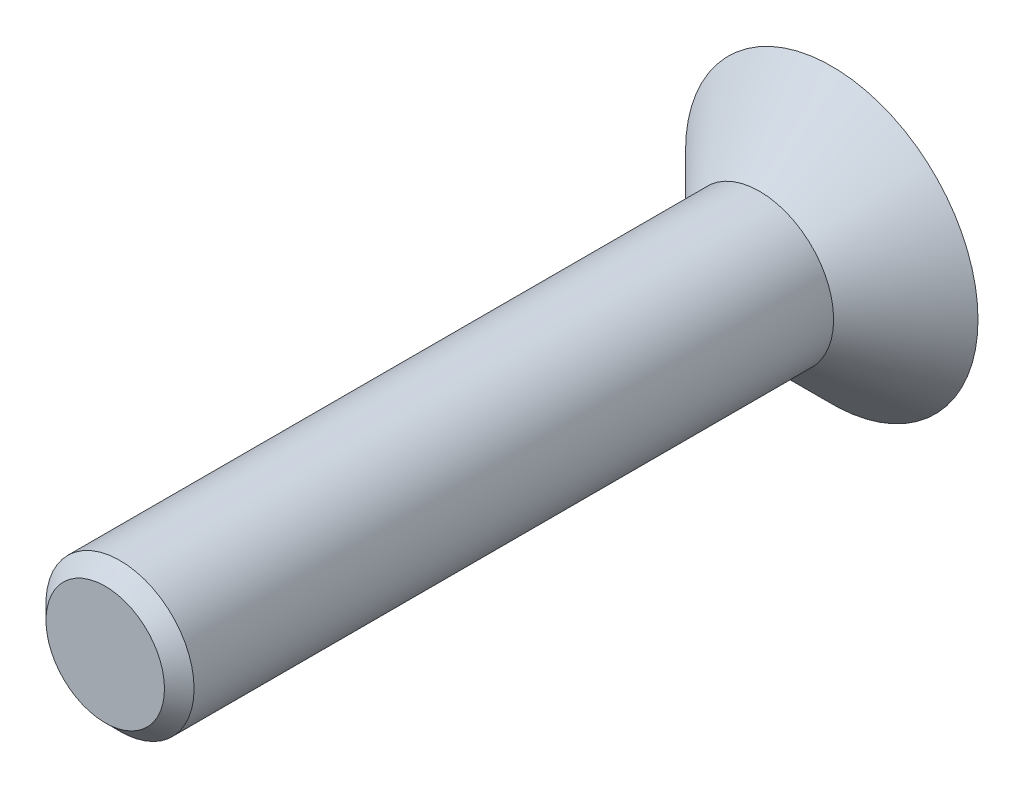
from build123d import *

# Parameters (mm, degrees)
FENTE1_DEPTH    = 3.8
ESQUISSE3_W     = 4
ESQUISSE3_H     = 35.35
CHANFREIN1_SIZE = 0.8


with BuildPart() as part:
    # Esquisse1 → Base-R_volution (revolve)
    with BuildSketch(Plane(origin=(0, 0, 0), x_dir=(1, 0, 0), z_dir=(0, 1, 0)), mode=Mode.PRIVATE) as base_r_volution_sk:
        Polygon((4, 0), (7.9, 3.9), (0, 3.9), (0, 0), align=None)
    revolve(base_r_volution_sk.sketch.rotate(Axis((0, 0, 0), (0, 0, -1)), 180), axis=Axis((0, 0, 0), (0, 0, -1)))

    # Esquisse2 → fente1 (cut)
    with BuildSketch(Plane.XY.offset(-3.9)):
        Polygon((2.5, -1.443375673), (2.5, 1.443375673), (0, 2.886751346), (-2.5, 1.443375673), (-2.5, -1.443375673), (0, -2.886751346), align=None)
    extrude(amount=FENTE1_DEPTH, mode=Mode.SUBTRACT)

    # Esquisse3 → Boss.-R_vol.1 (revolve)
    with BuildSketch(Plane(origin=(0, 0, 0), x_dir=(1, 0, 0), z_dir=(0, 1, 0))):
        with Locations((2, -17.675)):
            Rectangle(ESQUISSE3_W, ESQUISSE3_H)
    revolve(axis=Axis((0, 0, 0), (0, 0, 1)))

    # Chanfrein1
    chanfrein1_edges = [part.edges().sort_by_distance(p)[0] for p in [
        (-4, 0, 35.35),
    ]]
    chamfer(chanfrein1_edges, length=CHANFREIN1_SIZE)


solid = part.part
